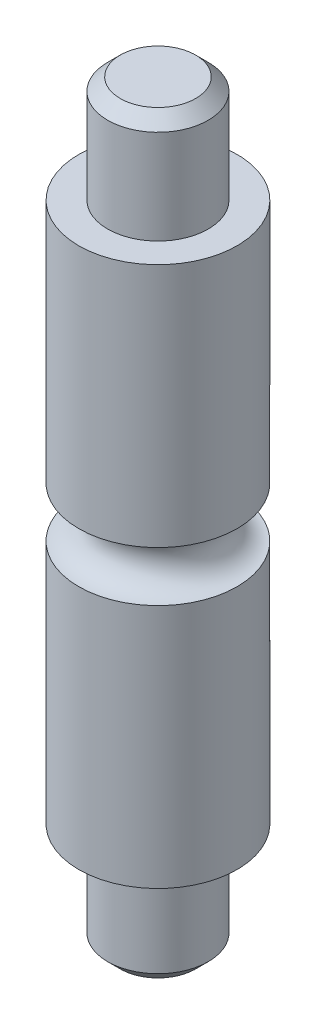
from build123d import *

# Parameters (mm, degrees)
BOSS_EXTRU_1_DEPTH      = 10.75
BOSS_EXTRU_1_DEPTH_BACK = 10.75
ESQUISSE1_R             = 3.15
ESQUISSE2_R             = 2
BOSS_EXTRU_2_DEPTH      = 4.25
CHANFREIN1_SIZE         = 0.5
ESQUISSE3_R             = 1


with BuildPart() as part:
    # Esquisse1 → Boss.-Extru.1 (new, two sides: drawn at the far end of the back side and taken through both)
    with BuildSketch(Plane(origin=(0, 0, 0), x_dir=(1, 0, 0), z_dir=(0, 1, 0)).offset(-BOSS_EXTRU_1_DEPTH_BACK)):
        with Locations(Location((0, 0, 0), (0, 0, 270))):
            Circle(ESQUISSE1_R)
    extrude(amount=BOSS_EXTRU_1_DEPTH + BOSS_EXTRU_1_DEPTH_BACK)

    # Esquisse2 → Boss.-Extru.2 (add)
    with BuildSketch(Plane(origin=(0, 10.75, 0), x_dir=(1, 0, 0), z_dir=(0, 1, 0))):
        with Locations(Location((0, 0, 0), (0, 0, 270))):
            Circle(ESQUISSE2_R)
    boss_extru_2 = extrude(amount=BOSS_EXTRU_2_DEPTH)

    # Sym_trie3: Boss.-Extru.2 across plane
    add(boss_extru_2.mirror(Plane.ZX))

    # Chanfrein1
    chanfrein1_edges = [part.edges().sort_by_distance(p)[0] for p in [
        (0, -15, -2),
        (0, 15, -2),
    ]]
    chamfer(chanfrein1_edges, length=CHANFREIN1_SIZE)

    # Esquisse3 → Enl_vement de mati_re-R_volution1 (revolve, cut)
    with BuildSketch(Plane(origin=(0, 0, 0), x_dir=(0, 0, -1), z_dir=(1, 0, 0)), mode=Mode.PRIVATE) as enl_vement_de_mati_re_r_volution1_sk:
        with Locations((3.15, 0)):
            Circle(ESQUISSE3_R)
    revolve(enl_vement_de_mati_re_r_volution1_sk.sketch.rotate(Axis((0, 0, 0), (0, 1, 0)), 180), axis=Axis((0, 0, 0), (0, 1, 0)), mode=Mode.SUBTRACT)


solid = part.part
